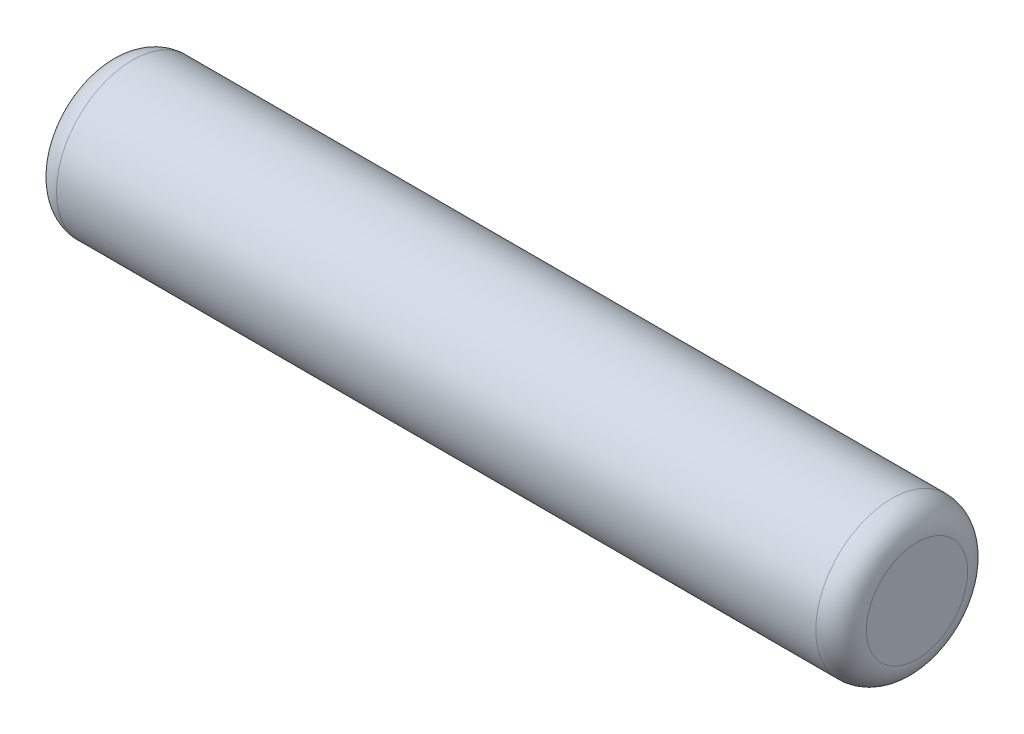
ISO-10303-21;
HEADER;
FILE_DESCRIPTION(('STEP AP214'),'2;1');
FILE_NAME('part.step','',(''),(''),'','','');
FILE_SCHEMA(('AUTOMOTIVE_DESIGN { 1 0 10303 214 1 1 1 1 }'));
ENDSEC;
DATA;
#1=APPLICATION_CONTEXT('core data for automotive mechanical design processes');
#2=APPLICATION_PROTOCOL_DEFINITION('international standard','automotive_design',2000,#1);
#3=PRODUCT_CONTEXT('',#1,'mechanical');
#4=PRODUCT('Part','Part','',(#3));
#5=PRODUCT_RELATED_PRODUCT_CATEGORY('part','',(#4));
#6=PRODUCT_DEFINITION_FORMATION('','',#4);
#7=PRODUCT_DEFINITION_CONTEXT('part definition',#1,'design');
#8=PRODUCT_DEFINITION('design','',#6,#7);
#9=PRODUCT_DEFINITION_SHAPE('','',#8);
#10=(LENGTH_UNIT() NAMED_UNIT(*) SI_UNIT(.MILLI.,.METRE.));
#11=(NAMED_UNIT(*) PLANE_ANGLE_UNIT() SI_UNIT($,.RADIAN.));
#12=(NAMED_UNIT(*) SI_UNIT($,.STERADIAN.) SOLID_ANGLE_UNIT());
#13=UNCERTAINTY_MEASURE_WITH_UNIT(LENGTH_MEASURE(1.E-05),#10,'distance_accuracy_value','');
#14=(GEOMETRIC_REPRESENTATION_CONTEXT(3) GLOBAL_UNCERTAINTY_ASSIGNED_CONTEXT((#13)) GLOBAL_UNIT_ASSIGNED_CONTEXT((#10,
#11,#12)) REPRESENTATION_CONTEXT('',''));
#15=CARTESIAN_POINT('',(0.,0.,0.));
#16=DIRECTION('',(0.,0.,1.));
#17=DIRECTION('',(1.,0.,0.));
#18=AXIS2_PLACEMENT_3D('',#15,#16,#17);
#19=CARTESIAN_POINT('',(0.,0.,0.));
#20=DIRECTION('',(1.,0.,0.));
#21=DIRECTION('',(0.,0.,-1.));
#22=AXIS2_PLACEMENT_3D('',#19,#20,#21);
#23=PLANE('',#22);
#24=CARTESIAN_POINT('',(0.,0.,0.));
#25=DIRECTION('',(1.,0.,0.));
#26=DIRECTION('',(0.,0.,-1.));
#27=AXIS2_PLACEMENT_3D('',#24,#25,#26);
#28=CIRCLE('',#27,2.);
#29=CARTESIAN_POINT('',(0.,0.,-2.));
#30=VERTEX_POINT('',#29);
#31=EDGE_CURVE('E29',#30,#30,#28,.F.);
#32=ORIENTED_EDGE('',*,*,#31,.T.);
#33=EDGE_LOOP('',(#32));
#34=FACE_BOUND('',#33,.T.);
#35=ADVANCED_FACE('F14',(#34),#23,.F.);
#36=CARTESIAN_POINT('',(0.,0.,0.));
#37=DIRECTION('',(-1.,0.,0.));
#38=DIRECTION('',(0.,0.,1.));
#39=AXIS2_PLACEMENT_3D('',#36,#37,#38);
#40=CYLINDRICAL_SURFACE('',#39,3.);
#41=CARTESIAN_POINT('',(1.,0.,0.));
#42=DIRECTION('',(1.,0.,0.));
#43=DIRECTION('',(0.,0.,-1.));
#44=AXIS2_PLACEMENT_3D('',#41,#42,#43);
#45=CIRCLE('',#44,3.);
#46=CARTESIAN_POINT('',(1.,0.,-3.));
#47=VERTEX_POINT('',#46);
#48=EDGE_CURVE('E21',#47,#47,#45,.T.);
#49=ORIENTED_EDGE('',*,*,#48,.T.);
#50=EDGE_LOOP('',(#49));
#51=FACE_BOUND('',#50,.T.);
#52=CARTESIAN_POINT('',(31.,0.,0.));
#53=DIRECTION('',(-1.,0.,0.));
#54=DIRECTION('',(0.,0.,1.));
#55=AXIS2_PLACEMENT_3D('',#52,#53,#54);
#56=CIRCLE('',#55,3.);
#57=CARTESIAN_POINT('',(31.,0.,3.));
#58=VERTEX_POINT('',#57);
#59=EDGE_CURVE('E25',#58,#58,#56,.T.);
#60=ORIENTED_EDGE('',*,*,#59,.T.);
#61=EDGE_LOOP('',(#60));
#62=FACE_BOUND('',#61,.T.);
#63=ADVANCED_FACE('F47',(#51,#62),#40,.T.);
#64=CARTESIAN_POINT('',(32.,3.,0.));
#65=DIRECTION('',(-1.,0.,0.));
#66=DIRECTION('',(0.,0.,1.));
#67=AXIS2_PLACEMENT_3D('',#64,#65,#66);
#68=PLANE('',#67);
#69=CARTESIAN_POINT('',(32.,0.,0.));
#70=DIRECTION('',(-1.,0.,0.));
#71=DIRECTION('',(0.,0.,1.));
#72=AXIS2_PLACEMENT_3D('',#69,#70,#71);
#73=CIRCLE('',#72,2.);
#74=CARTESIAN_POINT('',(32.,0.,2.));
#75=VERTEX_POINT('',#74);
#76=EDGE_CURVE('E9',#75,#75,#73,.F.);
#77=ORIENTED_EDGE('',*,*,#76,.T.);
#78=EDGE_LOOP('',(#77));
#79=FACE_BOUND('',#78,.T.);
#80=ADVANCED_FACE('F38',(#79),#68,.F.);
#81=CARTESIAN_POINT('',(1.,0.,0.));
#82=DIRECTION('',(1.,0.,0.));
#83=DIRECTION('',(0.,0.,-1.));
#84=AXIS2_PLACEMENT_3D('',#81,#82,#83);
#85=TOROIDAL_SURFACE('',#84,2.,1.);
#86=ORIENTED_EDGE('',*,*,#48,.F.);
#87=EDGE_LOOP('',(#86));
#88=FACE_BOUND('',#87,.T.);
#89=ORIENTED_EDGE('',*,*,#31,.F.);
#90=EDGE_LOOP('',(#89));
#91=FACE_BOUND('',#90,.T.);
#92=ADVANCED_FACE('F36',(#88,#91),#85,.T.);
#93=CARTESIAN_POINT('',(31.,0.,0.));
#94=DIRECTION('',(-1.,0.,0.));
#95=DIRECTION('',(0.,0.,1.));
#96=AXIS2_PLACEMENT_3D('',#93,#94,#95);
#97=TOROIDAL_SURFACE('',#96,2.,1.);
#98=ORIENTED_EDGE('',*,*,#76,.F.);
#99=EDGE_LOOP('',(#98));
#100=FACE_BOUND('',#99,.T.);
#101=ORIENTED_EDGE('',*,*,#59,.F.);
#102=EDGE_LOOP('',(#101));
#103=FACE_BOUND('',#102,.T.);
#104=ADVANCED_FACE('F16',(#100,#103),#97,.T.);
#105=CLOSED_SHELL('',(#35,#63,#80,#92,#104));
#106=MANIFOLD_SOLID_BREP('B1',#105);
#107=ADVANCED_BREP_SHAPE_REPRESENTATION('',(#18,#106),#14);
#108=SHAPE_DEFINITION_REPRESENTATION(#9,#107);
ENDSEC;
END-ISO-10303-21;
